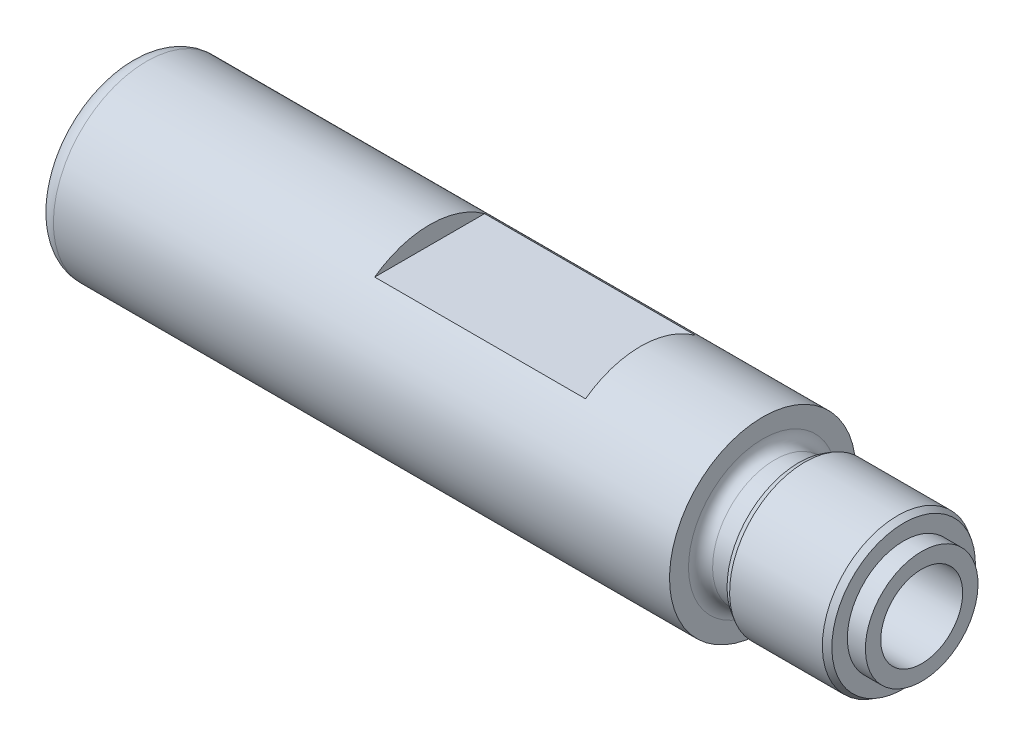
ISO-10303-21;
HEADER;
FILE_DESCRIPTION(('STEP AP214'),'2;1');
FILE_NAME('part.step','',(''),(''),'','','');
FILE_SCHEMA(('AUTOMOTIVE_DESIGN { 1 0 10303 214 1 1 1 1 }'));
ENDSEC;
DATA;
#1=APPLICATION_CONTEXT('core data for automotive mechanical design processes');
#2=APPLICATION_PROTOCOL_DEFINITION('international standard','automotive_design',2000,#1);
#3=PRODUCT_CONTEXT('',#1,'mechanical');
#4=PRODUCT('Part','Part','',(#3));
#5=PRODUCT_RELATED_PRODUCT_CATEGORY('part','',(#4));
#6=PRODUCT_DEFINITION_FORMATION('','',#4);
#7=PRODUCT_DEFINITION_CONTEXT('part definition',#1,'design');
#8=PRODUCT_DEFINITION('design','',#6,#7);
#9=PRODUCT_DEFINITION_SHAPE('','',#8);
#10=(LENGTH_UNIT() NAMED_UNIT(*) SI_UNIT(.MILLI.,.METRE.));
#11=(NAMED_UNIT(*) PLANE_ANGLE_UNIT() SI_UNIT($,.RADIAN.));
#12=(NAMED_UNIT(*) SI_UNIT($,.STERADIAN.) SOLID_ANGLE_UNIT());
#13=UNCERTAINTY_MEASURE_WITH_UNIT(LENGTH_MEASURE(1.E-05),#10,'distance_accuracy_value','');
#14=(GEOMETRIC_REPRESENTATION_CONTEXT(3) GLOBAL_UNCERTAINTY_ASSIGNED_CONTEXT((#13)) GLOBAL_UNIT_ASSIGNED_CONTEXT((#10,
#11,#12)) REPRESENTATION_CONTEXT('',''));
#15=CARTESIAN_POINT('',(0.,0.,0.));
#16=DIRECTION('',(0.,0.,1.));
#17=DIRECTION('',(1.,0.,0.));
#18=AXIS2_PLACEMENT_3D('',#15,#16,#17);
#19=CARTESIAN_POINT('',(-31.9278,0.,0.));
#20=DIRECTION('',(1.,0.,0.));
#21=DIRECTION('',(0.,1.,0.));
#22=AXIS2_PLACEMENT_3D('',#19,#20,#21);
#23=TOROIDAL_SURFACE('',#22,3.16865,0.761999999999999);
#24=CARTESIAN_POINT('',(-32.6898,0.,0.));
#25=DIRECTION('',(1.,0.,0.));
#26=DIRECTION('',(0.,1.,0.));
#27=AXIS2_PLACEMENT_3D('',#24,#25,#26);
#28=CIRCLE('',#27,3.16864999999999);
#29=CARTESIAN_POINT('',(-32.6898,3.16864999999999,0.));
#30=VERTEX_POINT('',#29);
#31=EDGE_CURVE('E97',#30,#30,#28,.T.);
#32=ORIENTED_EDGE('',*,*,#31,.T.);
#33=EDGE_LOOP('',(#32));
#34=FACE_BOUND('',#33,.T.);
#35=CARTESIAN_POINT('',(-31.9278,0.,0.));
#36=DIRECTION('',(1.,0.,0.));
#37=DIRECTION('',(0.,1.,0.));
#38=AXIS2_PLACEMENT_3D('',#35,#36,#37);
#39=CIRCLE('',#38,3.93065);
#40=CARTESIAN_POINT('',(-31.9278,3.93065,0.));
#41=VERTEX_POINT('',#40);
#42=EDGE_CURVE('E142',#41,#41,#39,.T.);
#43=ORIENTED_EDGE('',*,*,#42,.F.);
#44=EDGE_LOOP('',(#43));
#45=FACE_BOUND('',#44,.T.);
#46=ADVANCED_FACE('F31',(#34,#45),#23,.T.);
#47=CARTESIAN_POINT('',(-32.6898,3.16864999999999,0.));
#48=DIRECTION('',(-1.,0.,0.));
#49=DIRECTION('',(0.,-1.,0.));
#50=AXIS2_PLACEMENT_3D('',#47,#48,#49);
#51=PLANE('',#50);
#52=CARTESIAN_POINT('',(-32.6898,0.,0.));
#53=DIRECTION('',(1.,0.,0.));
#54=DIRECTION('',(0.,1.,0.));
#55=AXIS2_PLACEMENT_3D('',#52,#53,#54);
#56=CIRCLE('',#55,1.3081);
#57=CARTESIAN_POINT('',(-32.6898,1.3081,0.));
#58=VERTEX_POINT('',#57);
#59=EDGE_CURVE('E100',#58,#58,#56,.T.);
#60=ORIENTED_EDGE('',*,*,#59,.T.);
#61=EDGE_LOOP('',(#60));
#62=FACE_BOUND('',#61,.T.);
#63=ORIENTED_EDGE('',*,*,#31,.F.);
#64=EDGE_LOOP('',(#63));
#65=FACE_BOUND('',#64,.T.);
#66=ADVANCED_FACE('F161',(#62,#65),#51,.T.);
#67=CARTESIAN_POINT('',(0.,0.,0.));
#68=DIRECTION('',(1.,0.,0.));
#69=DIRECTION('',(0.,1.,0.));
#70=AXIS2_PLACEMENT_3D('',#67,#68,#69);
#71=CYLINDRICAL_SURFACE('',#70,1.3081);
#72=CARTESIAN_POINT('',(-30.9118,0.,0.));
#73=DIRECTION('',(1.,0.,0.));
#74=DIRECTION('',(0.,1.,0.));
#75=AXIS2_PLACEMENT_3D('',#72,#73,#74);
#76=CIRCLE('',#75,1.3081);
#77=CARTESIAN_POINT('',(-30.9118,1.3081,0.));
#78=VERTEX_POINT('',#77);
#79=EDGE_CURVE('E103',#78,#78,#76,.T.);
#80=ORIENTED_EDGE('',*,*,#79,.T.);
#81=EDGE_LOOP('',(#80));
#82=FACE_BOUND('',#81,.T.);
#83=ORIENTED_EDGE('',*,*,#59,.F.);
#84=EDGE_LOOP('',(#83));
#85=FACE_BOUND('',#84,.T.);
#86=ADVANCED_FACE('F166',(#82,#85),#71,.F.);
#87=CARTESIAN_POINT('',(-30.9118,1.3081,0.));
#88=DIRECTION('',(1.,0.,0.));
#89=DIRECTION('',(0.,1.,0.));
#90=AXIS2_PLACEMENT_3D('',#87,#88,#89);
#91=PLANE('',#90);
#92=CARTESIAN_POINT('',(-30.9118,0.,0.));
#93=DIRECTION('',(1.,0.,0.));
#94=DIRECTION('',(0.,1.,0.));
#95=AXIS2_PLACEMENT_3D('',#92,#93,#94);
#96=CIRCLE('',#95,1.7272);
#97=CARTESIAN_POINT('',(-30.9118,1.7272,0.));
#98=VERTEX_POINT('',#97);
#99=EDGE_CURVE('E106',#98,#98,#96,.T.);
#100=ORIENTED_EDGE('',*,*,#99,.T.);
#101=EDGE_LOOP('',(#100));
#102=FACE_BOUND('',#101,.T.);
#103=ORIENTED_EDGE('',*,*,#79,.F.);
#104=EDGE_LOOP('',(#103));
#105=FACE_BOUND('',#104,.T.);
#106=ADVANCED_FACE('F241',(#102,#105),#91,.T.);
#107=CARTESIAN_POINT('',(0.,0.,0.));
#108=DIRECTION('',(1.,0.,0.));
#109=DIRECTION('',(0.,1.,0.));
#110=AXIS2_PLACEMENT_3D('',#107,#108,#109);
#111=CYLINDRICAL_SURFACE('',#110,1.7272);
#112=CARTESIAN_POINT('',(0.761999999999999,0.,0.));
#113=DIRECTION('',(1.,0.,0.));
#114=DIRECTION('',(0.,1.,0.));
#115=AXIS2_PLACEMENT_3D('',#112,#113,#114);
#116=CIRCLE('',#115,1.7272);
#117=CARTESIAN_POINT('',(0.761999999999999,1.7272,0.));
#118=VERTEX_POINT('',#117);
#119=EDGE_CURVE('E109',#118,#118,#116,.T.);
#120=ORIENTED_EDGE('',*,*,#119,.T.);
#121=EDGE_LOOP('',(#120));
#122=FACE_BOUND('',#121,.T.);
#123=ORIENTED_EDGE('',*,*,#99,.F.);
#124=EDGE_LOOP('',(#123));
#125=FACE_BOUND('',#124,.T.);
#126=ADVANCED_FACE('F235',(#122,#125),#111,.F.);
#127=CARTESIAN_POINT('',(0.761999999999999,2.3749,0.));
#128=DIRECTION('',(1.,0.,0.));
#129=DIRECTION('',(0.,1.,0.));
#130=AXIS2_PLACEMENT_3D('',#127,#128,#129);
#131=PLANE('',#130);
#132=CARTESIAN_POINT('',(0.761999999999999,0.,0.));
#133=DIRECTION('',(1.,0.,0.));
#134=DIRECTION('',(0.,1.,0.));
#135=AXIS2_PLACEMENT_3D('',#132,#133,#134);
#136=CIRCLE('',#135,2.3749);
#137=CARTESIAN_POINT('',(0.761999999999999,2.3749,0.));
#138=VERTEX_POINT('',#137);
#139=EDGE_CURVE('E112',#138,#138,#136,.T.);
#140=ORIENTED_EDGE('',*,*,#139,.T.);
#141=EDGE_LOOP('',(#140));
#142=FACE_BOUND('',#141,.T.);
#143=ORIENTED_EDGE('',*,*,#119,.F.);
#144=EDGE_LOOP('',(#143));
#145=FACE_BOUND('',#144,.T.);
#146=ADVANCED_FACE('F229',(#142,#145),#131,.T.);
#147=CARTESIAN_POINT('',(0.,0.,0.));
#148=DIRECTION('',(1.,0.,0.));
#149=DIRECTION('',(0.,1.,0.));
#150=AXIS2_PLACEMENT_3D('',#147,#148,#149);
#151=CYLINDRICAL_SURFACE('',#150,2.3749);
#152=CARTESIAN_POINT('',(0.,0.,0.));
#153=DIRECTION('',(1.,0.,0.));
#154=DIRECTION('',(0.,1.,0.));
#155=AXIS2_PLACEMENT_3D('',#152,#153,#154);
#156=CIRCLE('',#155,2.3749);
#157=CARTESIAN_POINT('',(0.,2.3749,0.));
#158=VERTEX_POINT('',#157);
#159=EDGE_CURVE('E115',#158,#158,#156,.T.);
#160=ORIENTED_EDGE('',*,*,#159,.T.);
#161=EDGE_LOOP('',(#160));
#162=FACE_BOUND('',#161,.T.);
#163=ORIENTED_EDGE('',*,*,#139,.F.);
#164=EDGE_LOOP('',(#163));
#165=FACE_BOUND('',#164,.T.);
#166=ADVANCED_FACE('F223',(#162,#165),#151,.T.);
#167=CARTESIAN_POINT('',(0.,2.3749,0.));
#168=DIRECTION('',(1.,0.,0.));
#169=DIRECTION('',(0.,1.,0.));
#170=AXIS2_PLACEMENT_3D('',#167,#168,#169);
#171=PLANE('',#170);
#172=CARTESIAN_POINT('',(0.,0.,0.));
#173=DIRECTION('',(1.,0.,0.));
#174=DIRECTION('',(0.,1.,0.));
#175=AXIS2_PLACEMENT_3D('',#172,#173,#174);
#176=CIRCLE('',#175,3.02835303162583);
#177=CARTESIAN_POINT('',(0.,3.02835303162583,0.));
#178=VERTEX_POINT('',#177);
#179=EDGE_CURVE('E118',#178,#178,#176,.T.);
#180=ORIENTED_EDGE('',*,*,#179,.T.);
#181=EDGE_LOOP('',(#180));
#182=FACE_BOUND('',#181,.T.);
#183=ORIENTED_EDGE('',*,*,#159,.F.);
#184=EDGE_LOOP('',(#183));
#185=FACE_BOUND('',#184,.T.);
#186=ADVANCED_FACE('F217',(#182,#185),#171,.T.);
#187=CARTESIAN_POINT('',(0.,0.,0.));
#188=DIRECTION('',(-1.,0.,0.));
#189=DIRECTION('',(0.,-1.,0.));
#190=AXIS2_PLACEMENT_3D('',#187,#188,#189);
#191=CONICAL_SURFACE('',#190,3.02835303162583,0.523598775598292);
#192=CARTESIAN_POINT('',(-0.254,0.,0.));
#193=DIRECTION('',(1.,0.,0.));
#194=DIRECTION('',(0.,1.,0.));
#195=AXIS2_PLACEMENT_3D('',#192,#193,#194);
#196=CIRCLE('',#195,3.175);
#197=CARTESIAN_POINT('',(-0.254,3.175,0.));
#198=VERTEX_POINT('',#197);
#199=EDGE_CURVE('E121',#198,#198,#196,.T.);
#200=ORIENTED_EDGE('',*,*,#199,.T.);
#201=EDGE_LOOP('',(#200));
#202=FACE_BOUND('',#201,.T.);
#203=ORIENTED_EDGE('',*,*,#179,.F.);
#204=EDGE_LOOP('',(#203));
#205=FACE_BOUND('',#204,.T.);
#206=ADVANCED_FACE('F211',(#202,#205),#191,.T.);
#207=CARTESIAN_POINT('',(0.,0.,0.));
#208=DIRECTION('',(1.,0.,0.));
#209=DIRECTION('',(0.,1.,0.));
#210=AXIS2_PLACEMENT_3D('',#207,#208,#209);
#211=CYLINDRICAL_SURFACE('',#210,3.175);
#212=CARTESIAN_POINT('',(-4.1656,0.,0.));
#213=DIRECTION('',(1.,0.,0.));
#214=DIRECTION('',(0.,1.,0.));
#215=AXIS2_PLACEMENT_3D('',#212,#213,#214);
#216=CIRCLE('',#215,3.175);
#217=CARTESIAN_POINT('',(-4.1656,3.175,0.));
#218=VERTEX_POINT('',#217);
#219=EDGE_CURVE('E124',#218,#218,#216,.T.);
#220=ORIENTED_EDGE('',*,*,#219,.T.);
#221=EDGE_LOOP('',(#220));
#222=FACE_BOUND('',#221,.T.);
#223=ORIENTED_EDGE('',*,*,#199,.F.);
#224=EDGE_LOOP('',(#223));
#225=FACE_BOUND('',#224,.T.);
#226=ADVANCED_FACE('F205',(#222,#225),#211,.T.);
#227=CARTESIAN_POINT('',(-4.1656,0.,0.));
#228=DIRECTION('',(1.,0.,0.));
#229=DIRECTION('',(0.,1.,0.));
#230=AXIS2_PLACEMENT_3D('',#227,#228,#229);
#231=CONICAL_SURFACE('',#230,3.175,0.523598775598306);
#232=CARTESIAN_POINT('',(-4.4196,0.,0.));
#233=DIRECTION('',(1.,0.,0.));
#234=DIRECTION('',(0.,1.,0.));
#235=AXIS2_PLACEMENT_3D('',#232,#233,#234);
#236=CIRCLE('',#235,3.02835303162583);
#237=CARTESIAN_POINT('',(-4.4196,3.02835303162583,0.));
#238=VERTEX_POINT('',#237);
#239=EDGE_CURVE('E127',#238,#238,#236,.T.);
#240=ORIENTED_EDGE('',*,*,#239,.T.);
#241=EDGE_LOOP('',(#240));
#242=FACE_BOUND('',#241,.T.);
#243=ORIENTED_EDGE('',*,*,#219,.F.);
#244=EDGE_LOOP('',(#243));
#245=FACE_BOUND('',#244,.T.);
#246=ADVANCED_FACE('F199',(#242,#245),#231,.T.);
#247=CARTESIAN_POINT('',(-4.4196,2.62128,0.));
#248=DIRECTION('',(-1.,0.,0.));
#249=DIRECTION('',(0.,-1.,0.));
#250=AXIS2_PLACEMENT_3D('',#247,#248,#249);
#251=PLANE('',#250);
#252=CARTESIAN_POINT('',(-4.4196,0.,0.));
#253=DIRECTION('',(1.,0.,0.));
#254=DIRECTION('',(0.,1.,0.));
#255=AXIS2_PLACEMENT_3D('',#252,#253,#254);
#256=CIRCLE('',#255,2.62128);
#257=CARTESIAN_POINT('',(-4.4196,2.62128,0.));
#258=VERTEX_POINT('',#257);
#259=EDGE_CURVE('E130',#258,#258,#256,.T.);
#260=ORIENTED_EDGE('',*,*,#259,.T.);
#261=EDGE_LOOP('',(#260));
#262=FACE_BOUND('',#261,.T.);
#263=ORIENTED_EDGE('',*,*,#239,.F.);
#264=EDGE_LOOP('',(#263));
#265=FACE_BOUND('',#264,.T.);
#266=ADVANCED_FACE('F193',(#262,#265),#251,.T.);
#267=CARTESIAN_POINT('',(0.,0.,0.));
#268=DIRECTION('',(1.,0.,0.));
#269=DIRECTION('',(0.,1.,0.));
#270=AXIS2_PLACEMENT_3D('',#267,#268,#269);
#271=CYLINDRICAL_SURFACE('',#270,2.62128);
#272=CARTESIAN_POINT('',(-5.4356,0.,0.));
#273=DIRECTION('',(1.,0.,0.));
#274=DIRECTION('',(0.,1.,0.));
#275=AXIS2_PLACEMENT_3D('',#272,#273,#274);
#276=CIRCLE('',#275,2.62128);
#277=CARTESIAN_POINT('',(-5.4356,2.62128,0.));
#278=VERTEX_POINT('',#277);
#279=EDGE_CURVE('E133',#278,#278,#276,.T.);
#280=ORIENTED_EDGE('',*,*,#279,.T.);
#281=EDGE_LOOP('',(#280));
#282=FACE_BOUND('',#281,.T.);
#283=ORIENTED_EDGE('',*,*,#259,.F.);
#284=EDGE_LOOP('',(#283));
#285=FACE_BOUND('',#284,.T.);
#286=ADVANCED_FACE('F187',(#282,#285),#271,.T.);
#287=CARTESIAN_POINT('',(-5.4356,0.,0.));
#288=DIRECTION('',(1.,0.,0.));
#289=DIRECTION('',(0.,1.,0.));
#290=AXIS2_PLACEMENT_3D('',#287,#288,#289);
#291=TOROIDAL_SURFACE('',#290,3.12928,0.508);
#292=CARTESIAN_POINT('',(-5.9436,0.,0.));
#293=DIRECTION('',(1.,0.,0.));
#294=DIRECTION('',(0.,1.,0.));
#295=AXIS2_PLACEMENT_3D('',#292,#293,#294);
#296=CIRCLE('',#295,3.12928);
#297=CARTESIAN_POINT('',(-5.9436,3.12928,0.));
#298=VERTEX_POINT('',#297);
#299=EDGE_CURVE('E136',#298,#298,#296,.T.);
#300=ORIENTED_EDGE('',*,*,#299,.T.);
#301=EDGE_LOOP('',(#300));
#302=FACE_BOUND('',#301,.T.);
#303=ORIENTED_EDGE('',*,*,#279,.F.);
#304=EDGE_LOOP('',(#303));
#305=FACE_BOUND('',#304,.T.);
#306=ADVANCED_FACE('F181',(#302,#305),#291,.F.);
#307=CARTESIAN_POINT('',(-5.9436,3.93065,0.));
#308=DIRECTION('',(1.,0.,0.));
#309=DIRECTION('',(0.,1.,0.));
#310=AXIS2_PLACEMENT_3D('',#307,#308,#309);
#311=PLANE('',#310);
#312=CARTESIAN_POINT('',(-5.9436,0.,0.));
#313=DIRECTION('',(1.,0.,0.));
#314=DIRECTION('',(0.,1.,0.));
#315=AXIS2_PLACEMENT_3D('',#312,#313,#314);
#316=CIRCLE('',#315,3.93065);
#317=CARTESIAN_POINT('',(-5.9436,3.93065,0.));
#318=VERTEX_POINT('',#317);
#319=EDGE_CURVE('E139',#318,#318,#316,.T.);
#320=ORIENTED_EDGE('',*,*,#319,.T.);
#321=EDGE_LOOP('',(#320));
#322=FACE_BOUND('',#321,.T.);
#323=ORIENTED_EDGE('',*,*,#299,.F.);
#324=EDGE_LOOP('',(#323));
#325=FACE_BOUND('',#324,.T.);
#326=ADVANCED_FACE('F175',(#322,#325),#311,.T.);
#327=CARTESIAN_POINT('',(0.,0.,0.));
#328=DIRECTION('',(1.,0.,0.));
#329=DIRECTION('',(0.,1.,0.));
#330=AXIS2_PLACEMENT_3D('',#327,#328,#329);
#331=CYLINDRICAL_SURFACE('',#330,3.93065);
#332=CARTESIAN_POINT('',(-19.9898,0.,0.));
#333=DIRECTION('',(-1.,0.,0.));
#334=DIRECTION('',(0.,0.,1.));
#335=AXIS2_PLACEMENT_3D('',#332,#333,#334);
#336=CIRCLE('',#335,3.93065);
#337=CARTESIAN_POINT('',(-19.9898,-3.175,2.31719322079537));
#338=VERTEX_POINT('',#337);
#339=CARTESIAN_POINT('',(-19.9898,-3.175,-2.31719322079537));
#340=VERTEX_POINT('',#339);
#341=EDGE_CURVE('E11',#338,#340,#336,.F.);
#342=ORIENTED_EDGE('',*,*,#341,.F.);
#343=DIRECTION('',(1.,0.,0.));
#344=VECTOR('',#343,1.);
#345=CARTESIAN_POINT('',(0.,-3.175,2.31719322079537));
#346=LINE('',#345,#344);
#347=CARTESIAN_POINT('',(-11.0998,-3.175,2.31719322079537));
#348=VERTEX_POINT('',#347);
#349=EDGE_CURVE('E73',#338,#348,#346,.T.);
#350=ORIENTED_EDGE('',*,*,#349,.T.);
#351=CARTESIAN_POINT('',(-11.0998,0.,0.));
#352=DIRECTION('',(-1.,0.,0.));
#353=DIRECTION('',(0.,0.,1.));
#354=AXIS2_PLACEMENT_3D('',#351,#352,#353);
#355=CIRCLE('',#354,3.93065);
#356=CARTESIAN_POINT('',(-11.0998,-3.175,-2.31719322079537));
#357=VERTEX_POINT('',#356);
#358=EDGE_CURVE('E68',#348,#357,#355,.F.);
#359=ORIENTED_EDGE('',*,*,#358,.T.);
#360=DIRECTION('',(1.,0.,0.));
#361=VECTOR('',#360,1.);
#362=CARTESIAN_POINT('',(0.,-3.175,-2.31719322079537));
#363=LINE('',#362,#361);
#364=EDGE_CURVE('E38',#357,#340,#363,.F.);
#365=ORIENTED_EDGE('',*,*,#364,.T.);
#366=EDGE_LOOP('',(#342,#350,#359,#365));
#367=FACE_BOUND('',#366,.T.);
#368=CARTESIAN_POINT('',(-19.9898,0.,0.));
#369=DIRECTION('',(-1.,0.,0.));
#370=DIRECTION('',(0.,0.,1.));
#371=AXIS2_PLACEMENT_3D('',#368,#369,#370);
#372=CIRCLE('',#371,3.93065);
#373=CARTESIAN_POINT('',(-19.9898,3.175,-2.31719322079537));
#374=VERTEX_POINT('',#373);
#375=CARTESIAN_POINT('',(-19.9898,3.175,2.31719322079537));
#376=VERTEX_POINT('',#375);
#377=EDGE_CURVE('E74',#374,#376,#372,.F.);
#378=ORIENTED_EDGE('',*,*,#377,.F.);
#379=DIRECTION('',(1.,0.,0.));
#380=VECTOR('',#379,1.);
#381=CARTESIAN_POINT('',(0.,3.175,-2.31719322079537));
#382=LINE('',#381,#380);
#383=CARTESIAN_POINT('',(-11.0998,3.175,-2.31719322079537));
#384=VERTEX_POINT('',#383);
#385=EDGE_CURVE('E91',#374,#384,#382,.T.);
#386=ORIENTED_EDGE('',*,*,#385,.T.);
#387=CARTESIAN_POINT('',(-11.0998,0.,0.));
#388=DIRECTION('',(-1.,0.,0.));
#389=DIRECTION('',(0.,0.,1.));
#390=AXIS2_PLACEMENT_3D('',#387,#388,#389);
#391=CIRCLE('',#390,3.93065);
#392=CARTESIAN_POINT('',(-11.0998,3.175,2.31719322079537));
#393=VERTEX_POINT('',#392);
#394=EDGE_CURVE('E94',#384,#393,#391,.F.);
#395=ORIENTED_EDGE('',*,*,#394,.T.);
#396=DIRECTION('',(1.,0.,0.));
#397=VECTOR('',#396,1.);
#398=CARTESIAN_POINT('',(0.,3.175,2.31719322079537));
#399=LINE('',#398,#397);
#400=EDGE_CURVE('E88',#393,#376,#399,.F.);
#401=ORIENTED_EDGE('',*,*,#400,.T.);
#402=EDGE_LOOP('',(#378,#386,#395,#401));
#403=FACE_BOUND('',#402,.T.);
#404=ORIENTED_EDGE('',*,*,#42,.T.);
#405=EDGE_LOOP('',(#404));
#406=FACE_BOUND('',#405,.T.);
#407=ORIENTED_EDGE('',*,*,#319,.F.);
#408=EDGE_LOOP('',(#407));
#409=FACE_BOUND('',#408,.T.);
#410=ADVANCED_FACE('F83',(#367,#403,#406,#409),#331,.T.);
#411=CARTESIAN_POINT('',(-19.9898,3.175,-3.51366496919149));
#412=DIRECTION('',(0.,1.,0.));
#413=DIRECTION('',(-1.,0.,0.));
#414=AXIS2_PLACEMENT_3D('',#411,#412,#413);
#415=PLANE('',#414);
#416=DIRECTION('',(0.,0.,1.));
#417=VECTOR('',#416,1.);
#418=CARTESIAN_POINT('',(-11.0998,3.175,-3.51366496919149));
#419=LINE('',#418,#417);
#420=EDGE_CURVE('E51',#384,#393,#419,.T.);
#421=ORIENTED_EDGE('',*,*,#420,.F.);
#422=ORIENTED_EDGE('',*,*,#385,.F.);
#423=DIRECTION('',(0.,0.,1.));
#424=VECTOR('',#423,1.);
#425=CARTESIAN_POINT('',(-19.9898,3.175,-3.51366496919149));
#426=LINE('',#425,#424);
#427=EDGE_CURVE('E145',#374,#376,#426,.T.);
#428=ORIENTED_EDGE('',*,*,#427,.T.);
#429=ORIENTED_EDGE('',*,*,#400,.F.);
#430=EDGE_LOOP('',(#421,#422,#428,#429));
#431=FACE_BOUND('',#430,.T.);
#432=ADVANCED_FACE('F174',(#431),#415,.T.);
#433=CARTESIAN_POINT('',(-19.9898,3.175,-3.51366496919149));
#434=DIRECTION('',(-1.,0.,0.));
#435=DIRECTION('',(0.,0.,1.));
#436=AXIS2_PLACEMENT_3D('',#433,#434,#435);
#437=PLANE('',#436);
#438=ORIENTED_EDGE('',*,*,#377,.T.);
#439=ORIENTED_EDGE('',*,*,#427,.F.);
#440=EDGE_LOOP('',(#438,#439));
#441=FACE_BOUND('',#440,.T.);
#442=ADVANCED_FACE('F260',(#441),#437,.F.);
#443=CARTESIAN_POINT('',(-11.0998,3.175,-3.51366496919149));
#444=DIRECTION('',(-1.,0.,0.));
#445=DIRECTION('',(0.,0.,1.));
#446=AXIS2_PLACEMENT_3D('',#443,#444,#445);
#447=PLANE('',#446);
#448=ORIENTED_EDGE('',*,*,#420,.T.);
#449=ORIENTED_EDGE('',*,*,#394,.F.);
#450=EDGE_LOOP('',(#448,#449));
#451=FACE_BOUND('',#450,.T.);
#452=ADVANCED_FACE('F158',(#451),#447,.T.);
#453=CARTESIAN_POINT('',(-19.9898,-3.175,-3.98754741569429));
#454=DIRECTION('',(0.,-1.,0.));
#455=DIRECTION('',(0.,0.,-1.));
#456=AXIS2_PLACEMENT_3D('',#453,#454,#455);
#457=PLANE('',#456);
#458=DIRECTION('',(0.,0.,-1.));
#459=VECTOR('',#458,1.);
#460=CARTESIAN_POINT('',(-11.0998,-3.175,-3.98754741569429));
#461=LINE('',#460,#459);
#462=EDGE_CURVE('E44',#348,#357,#461,.T.);
#463=ORIENTED_EDGE('',*,*,#462,.F.);
#464=ORIENTED_EDGE('',*,*,#349,.F.);
#465=DIRECTION('',(0.,0.,-1.));
#466=VECTOR('',#465,1.);
#467=CARTESIAN_POINT('',(-19.9898,-3.175,-3.98754741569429));
#468=LINE('',#467,#466);
#469=EDGE_CURVE('E80',#338,#340,#468,.T.);
#470=ORIENTED_EDGE('',*,*,#469,.T.);
#471=ORIENTED_EDGE('',*,*,#364,.F.);
#472=EDGE_LOOP('',(#463,#464,#470,#471));
#473=FACE_BOUND('',#472,.T.);
#474=ADVANCED_FACE('F77',(#473),#457,.T.);
#475=CARTESIAN_POINT('',(-19.9898,-4.17975798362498,-3.98754741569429));
#476=DIRECTION('',(-1.,0.,0.));
#477=DIRECTION('',(0.,0.,1.));
#478=AXIS2_PLACEMENT_3D('',#475,#476,#477);
#479=PLANE('',#478);
#480=ORIENTED_EDGE('',*,*,#341,.T.);
#481=ORIENTED_EDGE('',*,*,#469,.F.);
#482=EDGE_LOOP('',(#480,#481));
#483=FACE_BOUND('',#482,.T.);
#484=ADVANCED_FACE('F150',(#483),#479,.F.);
#485=CARTESIAN_POINT('',(-11.0998,-4.17975798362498,-3.98754741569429));
#486=DIRECTION('',(-1.,0.,0.));
#487=DIRECTION('',(0.,0.,1.));
#488=AXIS2_PLACEMENT_3D('',#485,#486,#487);
#489=PLANE('',#488);
#490=ORIENTED_EDGE('',*,*,#462,.T.);
#491=ORIENTED_EDGE('',*,*,#358,.F.);
#492=EDGE_LOOP('',(#490,#491));
#493=FACE_BOUND('',#492,.T.);
#494=ADVANCED_FACE('F69',(#493),#489,.T.);
#495=CLOSED_SHELL('',(#46,#66,#86,#106,#126,#146,#166,#186,#206,#226,#246,#266,#286,#306,#326,
#410,#432,#442,#452,#474,#484,#494));
#496=MANIFOLD_SOLID_BREP('B2',#495);
#497=ADVANCED_BREP_SHAPE_REPRESENTATION('',(#18,#496),#14);
#498=SHAPE_DEFINITION_REPRESENTATION(#9,#497);
ENDSEC;
END-ISO-10303-21;
